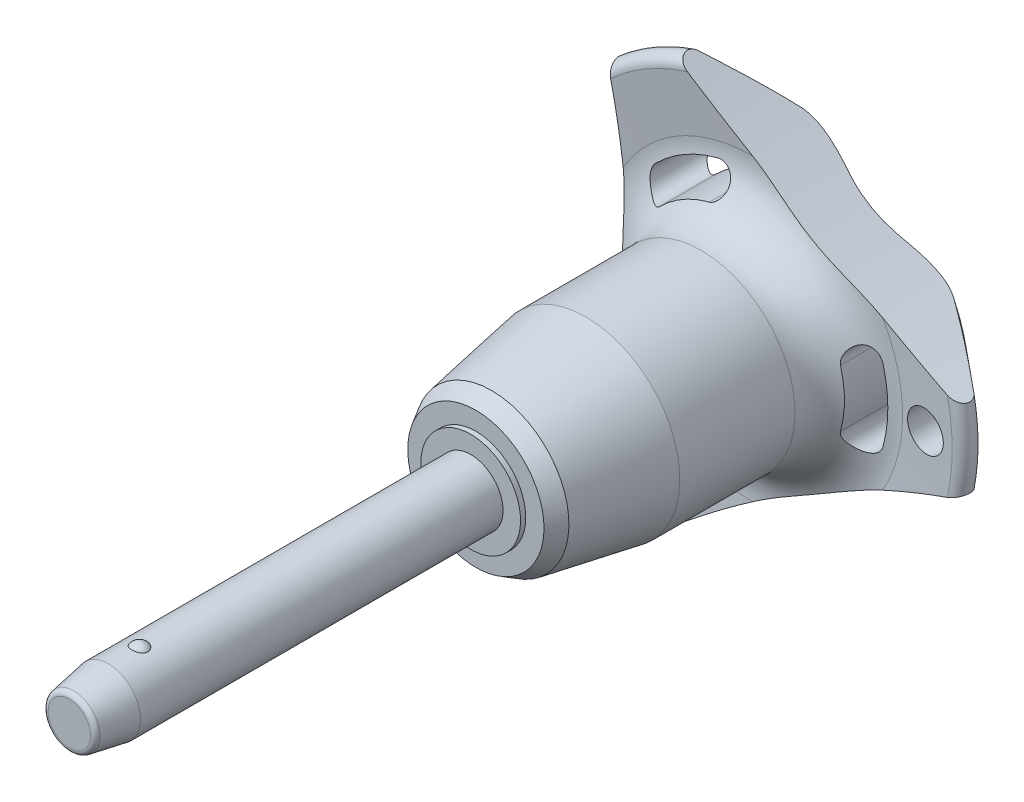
from build123d import *

# Parameters (mm, degrees)
SKETCH1_R           = 2.5
BOSS_EXTRUDE1_DEPTH = 25
SKETCH2_R           = 2.1
BOSS_EXTRUDE2_DEPTH = 26.7
BOSS_EXTRUDE3_START = 6
SKETCH1_2_R         = 2.5
BOSS_EXTRUDE3_DEPTH = 6
CHAMFER1_SIZE       = 3
CHAMFER1_SIZE2      = 0.528980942
FILLET1_R           = 0.4
SKETCH6_R           = 79.96
CUT_EXTRUDE1_DEPTH  = 57.781042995
CIRPATTERN1_COUNT   = 3
SKETCH7_R           = 1.5
CUT_EXTRUDE2_DEPTH  = 57.512343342


with BuildPart() as part:
    # Sketch1 → Boss-Extrude1 (new body)
    with BuildSketch(Plane.XY):
        Circle(SKETCH1_R)
    extrude(amount=-BOSS_EXTRUDE1_DEPTH)

    # Sketch2 → Boss-Extrude2 (add)
    with BuildSketch(Plane(origin=(0, 0, -25), x_dir=(-1, 0, 0), z_dir=(0, 0, -1))):
        Circle(SKETCH2_R)
    extrude(amount=BOSS_EXTRUDE2_DEPTH)

    # Sketch3 → Revolve1 (revolve)
    with BuildSketch(Plane(origin=(0, 0, 0), x_dir=(0, 0, -1), z_dir=(1, 0, 0))):
        with BuildLine():
            Line((-0.580947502, 2.75), (-0.580947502, 1.15))
            ThreePointArc((-0.580947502, 1.15), (0.219052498, 1.95), (-0.580947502, 2.75))
        make_face()
        with BuildLine():
            Line((-0.580947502, -1.15), (-0.580947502, -2.75))
            ThreePointArc((-0.580947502, -2.75), (0.219052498, -1.95), (-0.580947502, -1.15))
        make_face()
    revolve(axis=Axis((0, -1.15, 0.580947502), (0, 1, 0)))

    # Sketch1_2 → Boss-Extrude3 (add)
    with BuildSketch(Plane.XY.offset(BOSS_EXTRUDE3_START)):
        Circle(SKETCH1_2_R)
    extrude(amount=-BOSS_EXTRUDE3_DEPTH)

    # Chamfer1
    chamfer1_edges = [part.edges().sort_by_distance(p)[0] for p in [
        (-2.5, 0, 6),
    ]]
    chamfer1_side = [part.faces().sort_by_distance(p)[0] for p in [
        (-2.5, 0, -9.5),
    ]]
    chamfer(chamfer1_edges, length=CHAMFER1_SIZE, length2=CHAMFER1_SIZE2, reference=chamfer1_side[0])

    # Fillet1
    fillet1_edges = [part.edges().sort_by_distance(p)[0] for p in [
        (-1.971019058, 0, 6),
        (2.1, 0, -51.7),
    ]]
    fillet(fillet1_edges, radius=FILLET1_R)

    # Sketch4 → Revolve2 (revolve)
    with BuildSketch(Plane(origin=(0, 0, 0), x_dir=(0, 0, -1), z_dir=(1, 0, 0))):
        Polygon((25, 0), (25, 3.851837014), (25.4, 3.851837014), (25.4, 5.26161122), (26.620900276, 5.966498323), (33.9, 7.25), (42.8, 7.25), (42.8, 0), align=None)
    revolve(axis=Axis((0, 0, -42.8), (0, 0, 1)))

    # Sketch5 → Revolve3 (revolve)
    with BuildSketch(Plane(origin=(0, 0, 0), x_dir=(0, 0, -1), z_dir=(1, 0, 0)), mode=Mode.PRIVATE) as revolve3_sk:
        with BuildLine():
            Line((46.78715932, 11.570250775), (46.452568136, 15.735949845))
            ThreePointArc((46.452568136, 15.735949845), (46.946485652, 16.540188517), (47.862835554, 16.314230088))
            Line((47.862835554, 16.314230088), (51.326414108, 12.186497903))
            ThreePointArc((51.326414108, 12.186497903), (51.7, 11.109282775), (51.261488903, 10.056825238))
            ThreePointArc((51.261488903, 10.056825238), (48.289873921, 5.413681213), (47.25, 0))
            Line((47.25, 0), (42.8, 0))
            Line((42.8, 0), (42.8, 7.25))
            ThreePointArc((42.8, 7.25), (45.739473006, 8.537160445), (46.78715932, 11.570250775))
        make_face()
    revolve(revolve3_sk.sketch.rotate(Axis((0, 0, -47.25), (0, 0, 1)), 90), axis=Axis((0, 0, -47.25), (0, 0, 1)))

    # Sketch6 → Cut-Extrude1 (cut, through all)
    with BuildSketch(Plane.XY):
        with Locations((-89.76, 0)):
            Circle(SKETCH6_R)
        with BuildLine():
            ThreePointArc((10.113209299, -2.786941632), (10.490188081, 0), (10.113209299, 2.786941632))
            ThreePointArc((10.113209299, 2.786941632), (8.785018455, 3.541249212), (8.030710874, 2.213058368))
            ThreePointArc((8.030710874, 2.213058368), (8.330062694, 0), (8.030710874, -2.213058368))
            ThreePointArc((8.030710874, -2.213058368), (8.785018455, -3.541249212), (10.113209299, -2.786941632))
        make_face()
    cut_extrude1 = extrude(amount=-CUT_EXTRUDE1_DEPTH, mode=Mode.SUBTRACT)

    # CirPattern1: Cut-Extrude1 ×3 about axis
    cirpattern1_axis = Axis((0, 0, 0), (0, 0, 1))
    for i in range(1, CIRPATTERN1_COUNT):
        add(cut_extrude1.rotate(cirpattern1_axis, i * 360 / CIRPATTERN1_COUNT), mode=Mode.SUBTRACT)

    # Sketch7 → Cut-Extrude2 (cut, through all)
    with BuildSketch(Plane.XY):
        with Locations(Location((13.490188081, 0, 0), (0, 0, 225.221865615))):
            Circle(SKETCH7_R)
    extrude(amount=-CUT_EXTRUDE2_DEPTH, mode=Mode.SUBTRACT)


solid = part.part
